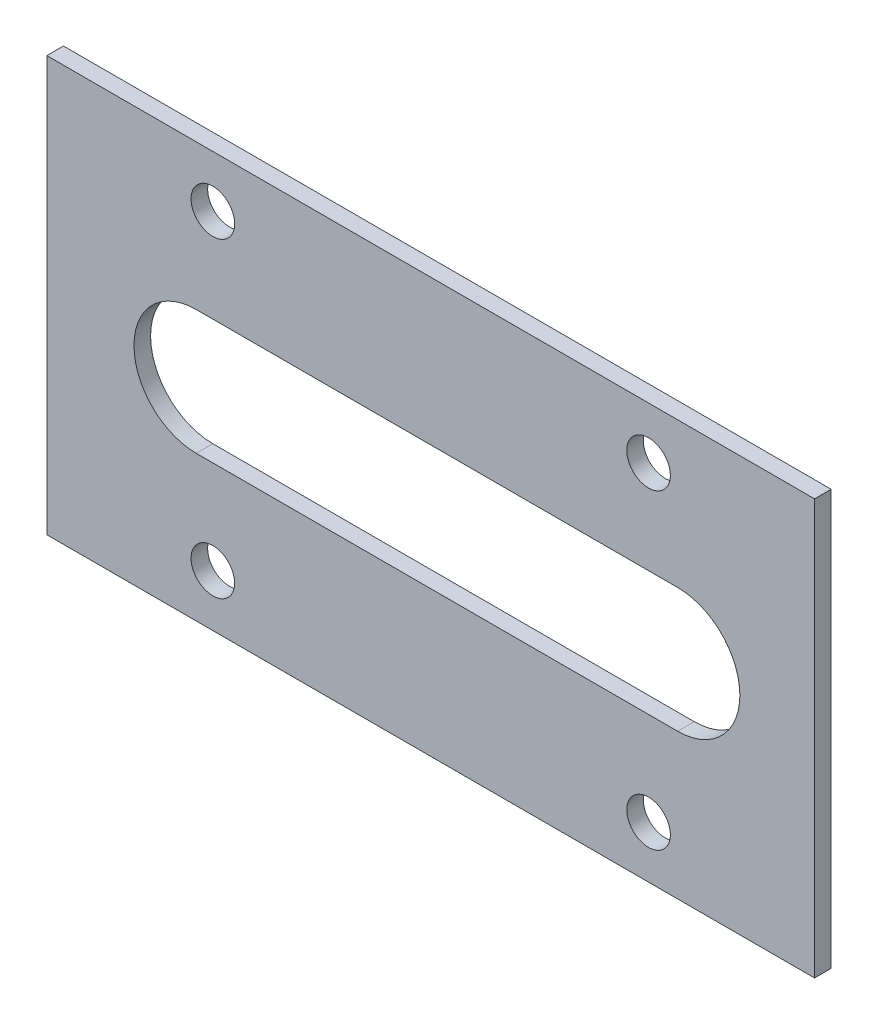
ISO-10303-21;
HEADER;
FILE_DESCRIPTION(('STEP AP214'),'2;1');
FILE_NAME('part.step','',(''),(''),'','','');
FILE_SCHEMA(('AUTOMOTIVE_DESIGN { 1 0 10303 214 1 1 1 1 }'));
ENDSEC;
DATA;
#1=APPLICATION_CONTEXT('core data for automotive mechanical design processes');
#2=APPLICATION_PROTOCOL_DEFINITION('international standard','automotive_design',2000,#1);
#3=PRODUCT_CONTEXT('',#1,'mechanical');
#4=PRODUCT('Part','Part','',(#3));
#5=PRODUCT_RELATED_PRODUCT_CATEGORY('part','',(#4));
#6=PRODUCT_DEFINITION_FORMATION('','',#4);
#7=PRODUCT_DEFINITION_CONTEXT('part definition',#1,'design');
#8=PRODUCT_DEFINITION('design','',#6,#7);
#9=PRODUCT_DEFINITION_SHAPE('','',#8);
#10=(LENGTH_UNIT() NAMED_UNIT(*) SI_UNIT(.MILLI.,.METRE.));
#11=(NAMED_UNIT(*) PLANE_ANGLE_UNIT() SI_UNIT($,.RADIAN.));
#12=(NAMED_UNIT(*) SI_UNIT($,.STERADIAN.) SOLID_ANGLE_UNIT());
#13=UNCERTAINTY_MEASURE_WITH_UNIT(LENGTH_MEASURE(1.E-05),#10,'distance_accuracy_value','');
#14=(GEOMETRIC_REPRESENTATION_CONTEXT(3) GLOBAL_UNCERTAINTY_ASSIGNED_CONTEXT((#13)) GLOBAL_UNIT_ASSIGNED_CONTEXT((#10,
#11,#12)) REPRESENTATION_CONTEXT('',''));
#15=CARTESIAN_POINT('',(0.,0.,0.));
#16=DIRECTION('',(0.,0.,1.));
#17=DIRECTION('',(1.,0.,0.));
#18=AXIS2_PLACEMENT_3D('',#15,#16,#17);
#19=CARTESIAN_POINT('',(-4.44089209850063E-13,2.22044604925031E-13,4.00000000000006));
#20=DIRECTION('',(0.,0.,1.));
#21=DIRECTION('',(1.,0.,0.));
#22=AXIS2_PLACEMENT_3D('',#19,#20,#21);
#23=PLANE('',#22);
#24=CARTESIAN_POINT('',(35.9999999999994,49.9999999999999,4.));
#25=DIRECTION('',(0.,0.,1.));
#26=DIRECTION('',(-1.,0.,0.));
#27=AXIS2_PLACEMENT_3D('',#24,#25,#26);
#28=CIRCLE('',#27,15.);
#29=CARTESIAN_POINT('',(35.9999999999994,65.0000000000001,3.99999999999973));
#30=VERTEX_POINT('',#29);
#31=CARTESIAN_POINT('',(35.9999999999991,35.,4.00000000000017));
#32=VERTEX_POINT('',#31);
#33=EDGE_CURVE('E68',#30,#32,#28,.T.);
#34=ORIENTED_EDGE('',*,*,#33,.F.);
#35=DIRECTION('',(-1.,0.,0.));
#36=VECTOR('',#35,1.);
#37=CARTESIAN_POINT('',(35.9999999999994,65.0000000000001,3.99999999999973));
#38=LINE('',#37,#36);
#39=CARTESIAN_POINT('',(151.999999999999,65.0000000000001,3.99999999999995));
#40=VERTEX_POINT('',#39);
#41=EDGE_CURVE('E137',#40,#30,#38,.T.);
#42=ORIENTED_EDGE('',*,*,#41,.F.);
#43=CARTESIAN_POINT('',(152.,50.0000000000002,3.99999999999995));
#44=DIRECTION('',(0.,0.,1.));
#45=DIRECTION('',(1.,0.,0.));
#46=AXIS2_PLACEMENT_3D('',#43,#44,#45);
#47=CIRCLE('',#46,15.);
#48=CARTESIAN_POINT('',(151.999999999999,35.0000000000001,4.00000000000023));
#49=VERTEX_POINT('',#48);
#50=EDGE_CURVE('E120',#49,#40,#47,.T.);
#51=ORIENTED_EDGE('',*,*,#50,.F.);
#52=DIRECTION('',(1.,0.,0.));
#53=VECTOR('',#52,1.);
#54=CARTESIAN_POINT('',(35.9999999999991,35.,4.00000000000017));
#55=LINE('',#54,#53);
#56=EDGE_CURVE('E130',#32,#49,#55,.T.);
#57=ORIENTED_EDGE('',*,*,#56,.F.);
#58=EDGE_LOOP('',(#34,#42,#51,#57));
#59=FACE_BOUND('',#58,.T.);
#60=CARTESIAN_POINT('',(145.,12.5,3.99999999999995));
#61=DIRECTION('',(0.,0.,1.));
#62=DIRECTION('',(1.,0.,0.));
#63=AXIS2_PLACEMENT_3D('',#60,#61,#62);
#64=CIRCLE('',#63,5.25);
#65=CARTESIAN_POINT('',(139.75,12.5,3.99999999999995));
#66=VERTEX_POINT('',#65);
#67=EDGE_CURVE('E177',#66,#66,#64,.T.);
#68=ORIENTED_EDGE('',*,*,#67,.F.);
#69=EDGE_LOOP('',(#68));
#70=FACE_BOUND('',#69,.T.);
#71=CARTESIAN_POINT('',(39.9999999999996,87.5,4.));
#72=DIRECTION('',(0.,0.,1.));
#73=DIRECTION('',(1.,0.,0.));
#74=AXIS2_PLACEMENT_3D('',#71,#72,#73);
#75=CIRCLE('',#74,5.25);
#76=CARTESIAN_POINT('',(34.7499999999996,87.5,4.));
#77=VERTEX_POINT('',#76);
#78=EDGE_CURVE('E193',#77,#77,#75,.T.);
#79=ORIENTED_EDGE('',*,*,#78,.F.);
#80=EDGE_LOOP('',(#79));
#81=FACE_BOUND('',#80,.T.);
#82=DIRECTION('',(0.,-1.,0.));
#83=VECTOR('',#82,1.);
#84=CARTESIAN_POINT('',(-6.66133814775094E-13,100.,4.));
#85=LINE('',#84,#83);
#86=CARTESIAN_POINT('',(-6.66133814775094E-13,100.,4.));
#87=VERTEX_POINT('',#86);
#88=CARTESIAN_POINT('',(-4.44089209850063E-13,2.22044604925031E-13,4.00000000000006));
#89=VERTEX_POINT('',#88);
#90=EDGE_CURVE('E209',#87,#89,#85,.T.);
#91=ORIENTED_EDGE('',*,*,#90,.T.);
#92=DIRECTION('',(1.,0.,0.));
#93=VECTOR('',#92,1.);
#94=CARTESIAN_POINT('',(-4.44089209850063E-13,2.22044604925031E-13,4.00000000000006));
#95=LINE('',#94,#93);
#96=CARTESIAN_POINT('',(185.,2.77555756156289E-13,3.99999999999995));
#97=VERTEX_POINT('',#96);
#98=EDGE_CURVE('E213',#89,#97,#95,.T.);
#99=ORIENTED_EDGE('',*,*,#98,.T.);
#100=DIRECTION('',(0.,1.,0.));
#101=VECTOR('',#100,1.);
#102=CARTESIAN_POINT('',(184.999999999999,100.,3.99999999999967));
#103=LINE('',#102,#101);
#104=CARTESIAN_POINT('',(184.999999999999,100.,3.99999999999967));
#105=VERTEX_POINT('',#104);
#106=EDGE_CURVE('E216',#97,#105,#103,.T.);
#107=ORIENTED_EDGE('',*,*,#106,.T.);
#108=DIRECTION('',(-1.,0.,0.));
#109=VECTOR('',#108,1.);
#110=CARTESIAN_POINT('',(-6.66133814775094E-13,100.,4.));
#111=LINE('',#110,#109);
#112=EDGE_CURVE('E219',#105,#87,#111,.T.);
#113=ORIENTED_EDGE('',*,*,#112,.T.);
#114=EDGE_LOOP('',(#91,#99,#107,#113));
#115=FACE_BOUND('',#114,.T.);
#116=CARTESIAN_POINT('',(145.,87.5000000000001,3.99999999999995));
#117=DIRECTION('',(0.,0.,1.));
#118=DIRECTION('',(1.,0.,0.));
#119=AXIS2_PLACEMENT_3D('',#116,#117,#118);
#120=CIRCLE('',#119,5.25);
#121=CARTESIAN_POINT('',(139.75,87.5000000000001,3.99999999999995));
#122=VERTEX_POINT('',#121);
#123=EDGE_CURVE('E185',#122,#122,#120,.T.);
#124=ORIENTED_EDGE('',*,*,#123,.F.);
#125=EDGE_LOOP('',(#124));
#126=FACE_BOUND('',#125,.T.);
#127=CARTESIAN_POINT('',(40.,12.5,4.00000000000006));
#128=DIRECTION('',(0.,0.,1.));
#129=DIRECTION('',(1.,0.,0.));
#130=AXIS2_PLACEMENT_3D('',#127,#128,#129);
#131=CIRCLE('',#130,5.25);
#132=CARTESIAN_POINT('',(34.75,12.5,4.00000000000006));
#133=VERTEX_POINT('',#132);
#134=EDGE_CURVE('E169',#133,#133,#131,.T.);
#135=ORIENTED_EDGE('',*,*,#134,.F.);
#136=EDGE_LOOP('',(#135));
#137=FACE_BOUND('',#136,.T.);
#138=ADVANCED_FACE('F52',(#59,#70,#81,#115,#126,#137),#23,.T.);
#139=CARTESIAN_POINT('',(0.,0.,0.));
#140=DIRECTION('',(0.,0.,1.));
#141=DIRECTION('',(1.,0.,0.));
#142=AXIS2_PLACEMENT_3D('',#139,#140,#141);
#143=PLANE('',#142);
#144=DIRECTION('',(-1.,0.,0.));
#145=VECTOR('',#144,1.);
#146=CARTESIAN_POINT('',(35.9999999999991,64.9999999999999,-1.11022302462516E-13));
#147=LINE('',#146,#145);
#148=CARTESIAN_POINT('',(152.,65.0000000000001,0.));
#149=VERTEX_POINT('',#148);
#150=CARTESIAN_POINT('',(35.9999999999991,64.9999999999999,-1.11022302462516E-13));
#151=VERTEX_POINT('',#150);
#152=EDGE_CURVE('E154',#149,#151,#147,.T.);
#153=ORIENTED_EDGE('',*,*,#152,.T.);
#154=CARTESIAN_POINT('',(35.9999999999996,49.9999999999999,1.11022302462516E-13));
#155=DIRECTION('',(0.,0.,1.));
#156=DIRECTION('',(-1.,0.,0.));
#157=AXIS2_PLACEMENT_3D('',#154,#155,#156);
#158=CIRCLE('',#157,15.);
#159=CARTESIAN_POINT('',(35.9999999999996,35.,1.66533453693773E-13));
#160=VERTEX_POINT('',#159);
#161=EDGE_CURVE('E143',#151,#160,#158,.T.);
#162=ORIENTED_EDGE('',*,*,#161,.T.);
#163=DIRECTION('',(1.,0.,0.));
#164=VECTOR('',#163,1.);
#165=CARTESIAN_POINT('',(35.9999999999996,35.,1.66533453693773E-13));
#166=LINE('',#165,#164);
#167=CARTESIAN_POINT('',(152.,35.,0.));
#168=VERTEX_POINT('',#167);
#169=EDGE_CURVE('E149',#160,#168,#166,.T.);
#170=ORIENTED_EDGE('',*,*,#169,.T.);
#171=CARTESIAN_POINT('',(151.999999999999,50.,2.22044604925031E-13));
#172=DIRECTION('',(0.,0.,1.));
#173=DIRECTION('',(1.,0.,0.));
#174=AXIS2_PLACEMENT_3D('',#171,#172,#173);
#175=CIRCLE('',#174,15.);
#176=EDGE_CURVE('E76',#168,#149,#175,.T.);
#177=ORIENTED_EDGE('',*,*,#176,.T.);
#178=EDGE_LOOP('',(#153,#162,#170,#177));
#179=FACE_BOUND('',#178,.T.);
#180=CARTESIAN_POINT('',(144.999999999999,12.5000000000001,-1.66533453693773E-13));
#181=DIRECTION('',(0.,0.,1.));
#182=DIRECTION('',(1.,0.,0.));
#183=AXIS2_PLACEMENT_3D('',#180,#181,#182);
#184=CIRCLE('',#183,5.25);
#185=CARTESIAN_POINT('',(139.75,12.5,-1.66533453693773E-13));
#186=VERTEX_POINT('',#185);
#187=EDGE_CURVE('E173',#186,#186,#184,.T.);
#188=ORIENTED_EDGE('',*,*,#187,.T.);
#189=EDGE_LOOP('',(#188));
#190=FACE_BOUND('',#189,.T.);
#191=CARTESIAN_POINT('',(39.9999999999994,87.5000000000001,1.11022302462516E-13));
#192=DIRECTION('',(0.,0.,1.));
#193=DIRECTION('',(1.,0.,0.));
#194=AXIS2_PLACEMENT_3D('',#191,#192,#193);
#195=CIRCLE('',#194,5.25);
#196=CARTESIAN_POINT('',(34.7499999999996,87.5,1.11022302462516E-13));
#197=VERTEX_POINT('',#196);
#198=EDGE_CURVE('E189',#197,#197,#195,.T.);
#199=ORIENTED_EDGE('',*,*,#198,.T.);
#200=EDGE_LOOP('',(#199));
#201=FACE_BOUND('',#200,.T.);
#202=DIRECTION('',(0.,-1.,0.));
#203=VECTOR('',#202,1.);
#204=CARTESIAN_POINT('',(-2.22044604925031E-13,100.,2.22044604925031E-13));
#205=LINE('',#204,#203);
#206=CARTESIAN_POINT('',(-2.22044604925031E-13,100.,2.22044604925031E-13));
#207=VERTEX_POINT('',#206);
#208=CARTESIAN_POINT('',(0.,0.,0.));
#209=VERTEX_POINT('',#208);
#210=EDGE_CURVE('E197',#207,#209,#205,.T.);
#211=ORIENTED_EDGE('',*,*,#210,.F.);
#212=DIRECTION('',(-1.,0.,0.));
#213=VECTOR('',#212,1.);
#214=CARTESIAN_POINT('',(-2.22044604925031E-13,100.,2.22044604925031E-13));
#215=LINE('',#214,#213);
#216=CARTESIAN_POINT('',(185.,100.,-1.11022302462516E-13));
#217=VERTEX_POINT('',#216);
#218=EDGE_CURVE('E207',#217,#207,#215,.T.);
#219=ORIENTED_EDGE('',*,*,#218,.F.);
#220=DIRECTION('',(0.,1.,0.));
#221=VECTOR('',#220,1.);
#222=CARTESIAN_POINT('',(185.,100.,-1.11022302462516E-13));
#223=LINE('',#222,#221);
#224=CARTESIAN_POINT('',(185.,-1.11022302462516E-13,0.));
#225=VERTEX_POINT('',#224);
#226=EDGE_CURVE('E204',#225,#217,#223,.T.);
#227=ORIENTED_EDGE('',*,*,#226,.F.);
#228=DIRECTION('',(1.,0.,0.));
#229=VECTOR('',#228,1.);
#230=CARTESIAN_POINT('',(0.,0.,0.));
#231=LINE('',#230,#229);
#232=EDGE_CURVE('E201',#209,#225,#231,.T.);
#233=ORIENTED_EDGE('',*,*,#232,.F.);
#234=EDGE_LOOP('',(#211,#219,#227,#233));
#235=FACE_BOUND('',#234,.T.);
#236=CARTESIAN_POINT('',(144.999999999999,87.5000000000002,2.22044604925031E-13));
#237=DIRECTION('',(0.,0.,1.));
#238=DIRECTION('',(1.,0.,0.));
#239=AXIS2_PLACEMENT_3D('',#236,#237,#238);
#240=CIRCLE('',#239,5.25);
#241=CARTESIAN_POINT('',(139.75,87.5000000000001,2.22044604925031E-13));
#242=VERTEX_POINT('',#241);
#243=EDGE_CURVE('E181',#242,#242,#240,.T.);
#244=ORIENTED_EDGE('',*,*,#243,.T.);
#245=EDGE_LOOP('',(#244));
#246=FACE_BOUND('',#245,.T.);
#247=CARTESIAN_POINT('',(40.,12.5,0.));
#248=DIRECTION('',(0.,0.,1.));
#249=DIRECTION('',(1.,0.,0.));
#250=AXIS2_PLACEMENT_3D('',#247,#248,#249);
#251=CIRCLE('',#250,5.25);
#252=CARTESIAN_POINT('',(34.75,12.5,0.));
#253=VERTEX_POINT('',#252);
#254=EDGE_CURVE('E161',#253,#253,#251,.T.);
#255=ORIENTED_EDGE('',*,*,#254,.T.);
#256=EDGE_LOOP('',(#255));
#257=FACE_BOUND('',#256,.T.);
#258=ADVANCED_FACE('F241',(#179,#190,#201,#235,#246,#257),#143,.F.);
#259=CARTESIAN_POINT('',(-6.66133814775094E-13,100.,4.));
#260=DIRECTION('',(1.,0.,0.));
#261=DIRECTION('',(0.,1.,0.));
#262=AXIS2_PLACEMENT_3D('',#259,#260,#261);
#263=PLANE('',#262);
#264=ORIENTED_EDGE('',*,*,#210,.T.);
#265=DIRECTION('',(0.,0.,-1.));
#266=VECTOR('',#265,1.);
#267=CARTESIAN_POINT('',(-4.44089209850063E-13,2.22044604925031E-13,4.00000000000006));
#268=LINE('',#267,#266);
#269=EDGE_CURVE('E11',#89,#209,#268,.T.);
#270=ORIENTED_EDGE('',*,*,#269,.F.);
#271=ORIENTED_EDGE('',*,*,#90,.F.);
#272=DIRECTION('',(0.,0.,-1.));
#273=VECTOR('',#272,1.);
#274=CARTESIAN_POINT('',(-6.66133814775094E-13,100.,4.));
#275=LINE('',#274,#273);
#276=EDGE_CURVE('E222',#87,#207,#275,.T.);
#277=ORIENTED_EDGE('',*,*,#276,.T.);
#278=EDGE_LOOP('',(#264,#270,#271,#277));
#279=FACE_BOUND('',#278,.T.);
#280=ADVANCED_FACE('F54',(#279),#263,.F.);
#281=CARTESIAN_POINT('',(-4.44089209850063E-13,2.22044604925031E-13,4.00000000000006));
#282=DIRECTION('',(0.,1.,0.));
#283=DIRECTION('',(0.,0.,1.));
#284=AXIS2_PLACEMENT_3D('',#281,#282,#283);
#285=PLANE('',#284);
#286=ORIENTED_EDGE('',*,*,#232,.T.);
#287=DIRECTION('',(0.,0.,-1.));
#288=VECTOR('',#287,1.);
#289=CARTESIAN_POINT('',(185.,2.77555756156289E-13,3.99999999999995));
#290=LINE('',#289,#288);
#291=EDGE_CURVE('E61',#97,#225,#290,.T.);
#292=ORIENTED_EDGE('',*,*,#291,.F.);
#293=ORIENTED_EDGE('',*,*,#98,.F.);
#294=ORIENTED_EDGE('',*,*,#269,.T.);
#295=EDGE_LOOP('',(#286,#292,#293,#294));
#296=FACE_BOUND('',#295,.T.);
#297=ADVANCED_FACE('F252',(#296),#285,.F.);
#298=CARTESIAN_POINT('',(184.999999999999,100.,3.99999999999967));
#299=DIRECTION('',(-1.,0.,0.));
#300=DIRECTION('',(0.,0.,1.));
#301=AXIS2_PLACEMENT_3D('',#298,#299,#300);
#302=PLANE('',#301);
#303=ORIENTED_EDGE('',*,*,#226,.T.);
#304=DIRECTION('',(0.,0.,-1.));
#305=VECTOR('',#304,1.);
#306=CARTESIAN_POINT('',(184.999999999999,100.,3.99999999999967));
#307=LINE('',#306,#305);
#308=EDGE_CURVE('E226',#105,#217,#307,.T.);
#309=ORIENTED_EDGE('',*,*,#308,.F.);
#310=ORIENTED_EDGE('',*,*,#106,.F.);
#311=ORIENTED_EDGE('',*,*,#291,.T.);
#312=EDGE_LOOP('',(#303,#309,#310,#311));
#313=FACE_BOUND('',#312,.T.);
#314=ADVANCED_FACE('F235',(#313),#302,.F.);
#315=CARTESIAN_POINT('',(-6.66133814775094E-13,100.,4.));
#316=DIRECTION('',(0.,-1.,0.));
#317=DIRECTION('',(0.,0.,-1.));
#318=AXIS2_PLACEMENT_3D('',#315,#316,#317);
#319=PLANE('',#318);
#320=ORIENTED_EDGE('',*,*,#218,.T.);
#321=ORIENTED_EDGE('',*,*,#276,.F.);
#322=ORIENTED_EDGE('',*,*,#112,.F.);
#323=ORIENTED_EDGE('',*,*,#308,.T.);
#324=EDGE_LOOP('',(#320,#321,#322,#323));
#325=FACE_BOUND('',#324,.T.);
#326=ADVANCED_FACE('F245',(#325),#319,.F.);
#327=CARTESIAN_POINT('',(39.9999999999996,87.5,4.));
#328=DIRECTION('',(0.,0.,-1.));
#329=DIRECTION('',(-1.,0.,0.));
#330=AXIS2_PLACEMENT_3D('',#327,#328,#329);
#331=CYLINDRICAL_SURFACE('',#330,5.25);
#332=CARTESIAN_POINT('',(34.7499999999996,87.5,4.));
#333=CARTESIAN_POINT('',(34.7499999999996,87.5,3.95833333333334));
#334=CARTESIAN_POINT('',(34.7499999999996,87.5,3.91666666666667));
#335=CARTESIAN_POINT('',(34.7499999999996,87.5,3.83333333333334));
#336=CARTESIAN_POINT('',(34.7499999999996,87.5,3.79166666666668));
#337=CARTESIAN_POINT('',(34.7499999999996,87.5,3.70833333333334));
#338=CARTESIAN_POINT('',(34.7499999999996,87.5,3.66666666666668));
#339=CARTESIAN_POINT('',(34.7499999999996,87.5,3.58333333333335));
#340=CARTESIAN_POINT('',(34.7499999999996,87.5,3.54166666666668));
#341=CARTESIAN_POINT('',(34.7499999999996,87.5,3.45833333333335));
#342=CARTESIAN_POINT('',(34.7499999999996,87.5,3.41666666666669));
#343=CARTESIAN_POINT('',(34.7499999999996,87.5,3.33333333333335));
#344=CARTESIAN_POINT('',(34.7499999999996,87.5,3.29166666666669));
#345=CARTESIAN_POINT('',(34.7499999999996,87.5,3.20833333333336));
#346=CARTESIAN_POINT('',(34.7499999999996,87.5,3.16666666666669));
#347=CARTESIAN_POINT('',(34.7499999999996,87.5,3.08333333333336));
#348=CARTESIAN_POINT('',(34.7499999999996,87.5,3.0416666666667));
#349=CARTESIAN_POINT('',(34.7499999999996,87.5,2.95833333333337));
#350=CARTESIAN_POINT('',(34.7499999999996,87.5,2.9166666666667));
#351=CARTESIAN_POINT('',(34.7499999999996,87.5,2.83333333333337));
#352=CARTESIAN_POINT('',(34.7499999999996,87.5,2.7916666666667));
#353=CARTESIAN_POINT('',(34.7499999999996,87.5,2.70833333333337));
#354=CARTESIAN_POINT('',(34.7499999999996,87.5,2.66666666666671));
#355=CARTESIAN_POINT('',(34.7499999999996,87.5,2.58333333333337));
#356=CARTESIAN_POINT('',(34.7499999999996,87.5,2.54166666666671));
#357=CARTESIAN_POINT('',(34.7499999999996,87.5,2.45833333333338));
#358=CARTESIAN_POINT('',(34.7499999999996,87.5,2.41666666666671));
#359=CARTESIAN_POINT('',(34.7499999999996,87.5,2.33333333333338));
#360=CARTESIAN_POINT('',(34.7499999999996,87.5,2.29166666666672));
#361=CARTESIAN_POINT('',(34.7499999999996,87.5,2.20833333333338));
#362=CARTESIAN_POINT('',(34.7499999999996,87.5,2.16666666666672));
#363=CARTESIAN_POINT('',(34.7499999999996,87.5,2.08333333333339));
#364=CARTESIAN_POINT('',(34.7499999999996,87.5,2.04166666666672));
#365=CARTESIAN_POINT('',(34.7499999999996,87.5,1.95833333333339));
#366=CARTESIAN_POINT('',(34.7499999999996,87.5,1.91666666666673));
#367=CARTESIAN_POINT('',(34.7499999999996,87.5,1.8333333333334));
#368=CARTESIAN_POINT('',(34.7499999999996,87.5,1.79166666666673));
#369=CARTESIAN_POINT('',(34.7499999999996,87.5,1.7083333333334));
#370=CARTESIAN_POINT('',(34.7499999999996,87.5,1.66666666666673));
#371=CARTESIAN_POINT('',(34.7499999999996,87.5,1.5833333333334));
#372=CARTESIAN_POINT('',(34.7499999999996,87.5,1.54166666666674));
#373=CARTESIAN_POINT('',(34.7499999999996,87.5,1.45833333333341));
#374=CARTESIAN_POINT('',(34.7499999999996,87.5,1.41666666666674));
#375=CARTESIAN_POINT('',(34.7499999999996,87.5,1.33333333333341));
#376=CARTESIAN_POINT('',(34.7499999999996,87.5,1.29166666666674));
#377=CARTESIAN_POINT('',(34.7499999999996,87.5,1.20833333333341));
#378=CARTESIAN_POINT('',(34.7499999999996,87.5,1.16666666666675));
#379=CARTESIAN_POINT('',(34.7499999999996,87.5,1.08333333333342));
#380=CARTESIAN_POINT('',(34.7499999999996,87.5,1.04166666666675));
#381=CARTESIAN_POINT('',(34.7499999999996,87.5,0.958333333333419));
#382=CARTESIAN_POINT('',(34.7499999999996,87.5,0.916666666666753));
#383=CARTESIAN_POINT('',(34.7499999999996,87.5,0.833333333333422));
#384=CARTESIAN_POINT('',(34.7499999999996,87.5,0.791666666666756));
#385=CARTESIAN_POINT('',(34.7499999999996,87.5,0.708333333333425));
#386=CARTESIAN_POINT('',(34.7499999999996,87.5,0.66666666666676));
#387=CARTESIAN_POINT('',(34.7499999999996,87.5,0.583333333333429));
#388=CARTESIAN_POINT('',(34.7499999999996,87.5,0.541666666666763));
#389=CARTESIAN_POINT('',(34.7499999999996,87.5,0.458333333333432));
#390=CARTESIAN_POINT('',(34.7499999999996,87.5,0.416666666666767));
#391=CARTESIAN_POINT('',(34.7499999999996,87.5,0.333333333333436));
#392=CARTESIAN_POINT('',(34.7499999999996,87.5,0.29166666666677));
#393=CARTESIAN_POINT('',(34.7499999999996,87.5,0.208333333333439));
#394=CARTESIAN_POINT('',(34.7499999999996,87.5,0.166666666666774));
#395=CARTESIAN_POINT('',(34.7499999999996,87.5,0.0833333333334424));
#396=CARTESIAN_POINT('',(34.7499999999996,87.5,0.0416666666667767));
#397=CARTESIAN_POINT('',(34.7499999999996,87.5,1.11022302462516E-13));
#398=B_SPLINE_CURVE_WITH_KNOTS('',3,(#332,#333,#334,#335,#336,#337,#338,#339,#340,#341,#342,
#343,#344,#345,#346,#347,#348,#349,#350,#351,#352,#353,#354,#355,#356,#357,#358,#359,#360,#361,
#362,#363,#364,#365,#366,#367,#368,#369,#370,#371,#372,#373,#374,#375,#376,#377,#378,#379,#380,
#381,#382,#383,#384,#385,#386,#387,#388,#389,#390,#391,#392,#393,#394,#395,#396,#397),
.UNSPECIFIED.,.F.,.F.,(4,2,2,2,2,2,2,2,2,2,2,2,2,2,2,2,2,2,2,2,2,2,2,2,2,2,2,2,2,2,2,2,4),(0.,
0.124999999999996,0.249999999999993,0.37499999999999,0.499999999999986,0.624999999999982,
0.749999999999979,0.874999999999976,0.999999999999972,1.12499999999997,1.24999999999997,
1.37499999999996,1.49999999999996,1.62499999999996,1.74999999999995,1.87499999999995,
1.99999999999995,2.12499999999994,2.24999999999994,2.37499999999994,2.49999999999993,
2.62499999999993,2.74999999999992,2.87499999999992,2.99999999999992,3.12499999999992,
3.24999999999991,3.37499999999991,3.4999999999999,3.6249999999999,3.7499999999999,
3.87499999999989,3.99999999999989),.UNSPECIFIED.);
#399=EDGE_CURVE('BSEAM269',#77,#197,#398,.T.);
#400=ORIENTED_EDGE('',*,*,#78,.T.);
#401=ORIENTED_EDGE('',*,*,#198,.F.);
#402=ORIENTED_EDGE('',*,*,#399,.T.);
#403=ORIENTED_EDGE('',*,*,#399,.F.);
#404=EDGE_LOOP('',(#400,#402,#401,#403));
#405=FACE_BOUND('',#404,.T.);
#406=ADVANCED_FACE('F269',(#405),#331,.F.);
#407=CARTESIAN_POINT('',(145.,87.5000000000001,3.99999999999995));
#408=DIRECTION('',(0.,0.,-1.));
#409=DIRECTION('',(-1.,0.,0.));
#410=AXIS2_PLACEMENT_3D('',#407,#408,#409);
#411=CYLINDRICAL_SURFACE('',#410,5.25);
#412=CARTESIAN_POINT('',(139.75,87.5000000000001,3.99999999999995));
#413=CARTESIAN_POINT('',(139.75,87.5000000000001,3.95833333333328));
#414=CARTESIAN_POINT('',(139.75,87.5000000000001,3.91666666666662));
#415=CARTESIAN_POINT('',(139.75,87.5000000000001,3.83333333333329));
#416=CARTESIAN_POINT('',(139.75,87.5000000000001,3.79166666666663));
#417=CARTESIAN_POINT('',(139.75,87.5000000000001,3.7083333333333));
#418=CARTESIAN_POINT('',(139.75,87.5000000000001,3.66666666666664));
#419=CARTESIAN_POINT('',(139.75,87.5000000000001,3.58333333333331));
#420=CARTESIAN_POINT('',(139.75,87.5000000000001,3.54166666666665));
#421=CARTESIAN_POINT('',(139.75,87.5000000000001,3.45833333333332));
#422=CARTESIAN_POINT('',(139.75,87.5000000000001,3.41666666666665));
#423=CARTESIAN_POINT('',(139.75,87.5000000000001,3.33333333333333));
#424=CARTESIAN_POINT('',(139.75,87.5000000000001,3.29166666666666));
#425=CARTESIAN_POINT('',(139.75,87.5000000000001,3.20833333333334));
#426=CARTESIAN_POINT('',(139.75,87.5000000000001,3.16666666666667));
#427=CARTESIAN_POINT('',(139.75,87.5000000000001,3.08333333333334));
#428=CARTESIAN_POINT('',(139.75,87.5000000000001,3.04166666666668));
#429=CARTESIAN_POINT('',(139.75,87.5000000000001,2.95833333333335));
#430=CARTESIAN_POINT('',(139.75,87.5000000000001,2.91666666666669));
#431=CARTESIAN_POINT('',(139.75,87.5000000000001,2.83333333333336));
#432=CARTESIAN_POINT('',(139.75,87.5000000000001,2.7916666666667));
#433=CARTESIAN_POINT('',(139.75,87.5000000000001,2.70833333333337));
#434=CARTESIAN_POINT('',(139.75,87.5000000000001,2.66666666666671));
#435=CARTESIAN_POINT('',(139.75,87.5000000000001,2.58333333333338));
#436=CARTESIAN_POINT('',(139.75,87.5000000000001,2.54166666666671));
#437=CARTESIAN_POINT('',(139.75,87.5000000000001,2.45833333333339));
#438=CARTESIAN_POINT('',(139.75,87.5000000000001,2.41666666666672));
#439=CARTESIAN_POINT('',(139.75,87.5000000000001,2.3333333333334));
#440=CARTESIAN_POINT('',(139.75,87.5000000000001,2.29166666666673));
#441=CARTESIAN_POINT('',(139.75,87.5000000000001,2.2083333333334));
#442=CARTESIAN_POINT('',(139.75,87.5000000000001,2.16666666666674));
#443=CARTESIAN_POINT('',(139.75,87.5000000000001,2.08333333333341));
#444=CARTESIAN_POINT('',(139.75,87.5000000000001,2.04166666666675));
#445=CARTESIAN_POINT('',(139.75,87.5000000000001,1.95833333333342));
#446=CARTESIAN_POINT('',(139.75,87.5000000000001,1.91666666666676));
#447=CARTESIAN_POINT('',(139.75,87.5000000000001,1.83333333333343));
#448=CARTESIAN_POINT('',(139.75,87.5000000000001,1.79166666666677));
#449=CARTESIAN_POINT('',(139.75,87.5000000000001,1.70833333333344));
#450=CARTESIAN_POINT('',(139.75,87.5000000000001,1.66666666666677));
#451=CARTESIAN_POINT('',(139.75,87.5000000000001,1.58333333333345));
#452=CARTESIAN_POINT('',(139.75,87.5000000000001,1.54166666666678));
#453=CARTESIAN_POINT('',(139.75,87.5000000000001,1.45833333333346));
#454=CARTESIAN_POINT('',(139.75,87.5000000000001,1.41666666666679));
#455=CARTESIAN_POINT('',(139.75,87.5000000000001,1.33333333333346));
#456=CARTESIAN_POINT('',(139.75,87.5000000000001,1.2916666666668));
#457=CARTESIAN_POINT('',(139.75,87.5000000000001,1.20833333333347));
#458=CARTESIAN_POINT('',(139.75,87.5000000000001,1.16666666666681));
#459=CARTESIAN_POINT('',(139.75,87.5000000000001,1.08333333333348));
#460=CARTESIAN_POINT('',(139.75,87.5000000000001,1.04166666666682));
#461=CARTESIAN_POINT('',(139.75,87.5000000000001,0.95833333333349));
#462=CARTESIAN_POINT('',(139.75,87.5000000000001,0.916666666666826));
#463=CARTESIAN_POINT('',(139.75,87.5000000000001,0.833333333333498));
#464=CARTESIAN_POINT('',(139.75,87.5000000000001,0.791666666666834));
#465=CARTESIAN_POINT('',(139.75,87.5000000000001,0.708333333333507));
#466=CARTESIAN_POINT('',(139.75,87.5000000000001,0.666666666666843));
#467=CARTESIAN_POINT('',(139.75,87.5000000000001,0.583333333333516));
#468=CARTESIAN_POINT('',(139.75,87.5000000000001,0.541666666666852));
#469=CARTESIAN_POINT('',(139.75,87.5000000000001,0.458333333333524));
#470=CARTESIAN_POINT('',(139.75,87.5000000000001,0.416666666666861));
#471=CARTESIAN_POINT('',(139.75,87.5000000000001,0.333333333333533));
#472=CARTESIAN_POINT('',(139.75,87.5000000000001,0.291666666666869));
#473=CARTESIAN_POINT('',(139.75,87.5000000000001,0.208333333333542));
#474=CARTESIAN_POINT('',(139.75,87.5000000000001,0.166666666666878));
#475=CARTESIAN_POINT('',(139.75,87.5000000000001,0.08333333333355));
#476=CARTESIAN_POINT('',(139.75,87.5000000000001,0.041666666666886));
#477=CARTESIAN_POINT('',(139.75,87.5000000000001,2.22044604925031E-13));
#478=B_SPLINE_CURVE_WITH_KNOTS('',3,(#412,#413,#414,#415,#416,#417,#418,#419,#420,#421,#422,
#423,#424,#425,#426,#427,#428,#429,#430,#431,#432,#433,#434,#435,#436,#437,#438,#439,#440,#441,
#442,#443,#444,#445,#446,#447,#448,#449,#450,#451,#452,#453,#454,#455,#456,#457,#458,#459,#460,
#461,#462,#463,#464,#465,#466,#467,#468,#469,#470,#471,#472,#473,#474,#475,#476,#477),
.UNSPECIFIED.,.F.,.F.,(4,2,2,2,2,2,2,2,2,2,2,2,2,2,2,2,2,2,2,2,2,2,2,2,2,2,2,2,2,2,2,2,4),(0.,
0.124999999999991,0.249999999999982,0.374999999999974,0.499999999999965,0.624999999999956,
0.749999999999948,0.874999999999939,0.999999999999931,1.12499999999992,1.24999999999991,
1.3749999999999,1.4999999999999,1.62499999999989,1.74999999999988,1.87499999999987,
1.99999999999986,2.12499999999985,2.24999999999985,2.37499999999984,2.49999999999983,
2.62499999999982,2.74999999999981,2.8749999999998,2.99999999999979,3.12499999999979,
3.24999999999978,3.37499999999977,3.49999999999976,3.62499999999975,3.74999999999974,
3.87499999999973,3.99999999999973),.UNSPECIFIED.);
#479=EDGE_CURVE('BSEAM273',#122,#242,#478,.T.);
#480=ORIENTED_EDGE('',*,*,#123,.T.);
#481=ORIENTED_EDGE('',*,*,#243,.F.);
#482=ORIENTED_EDGE('',*,*,#479,.T.);
#483=ORIENTED_EDGE('',*,*,#479,.F.);
#484=EDGE_LOOP('',(#480,#482,#481,#483));
#485=FACE_BOUND('',#484,.T.);
#486=ADVANCED_FACE('F273',(#485),#411,.F.);
#487=CARTESIAN_POINT('',(145.,12.5,3.99999999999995));
#488=DIRECTION('',(0.,0.,-1.));
#489=DIRECTION('',(-1.,0.,0.));
#490=AXIS2_PLACEMENT_3D('',#487,#488,#489);
#491=CYLINDRICAL_SURFACE('',#490,5.25);
#492=CARTESIAN_POINT('',(139.75,12.5,3.99999999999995));
#493=CARTESIAN_POINT('',(139.75,12.5,3.95833333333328));
#494=CARTESIAN_POINT('',(139.75,12.5,3.91666666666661));
#495=CARTESIAN_POINT('',(139.75,12.5,3.83333333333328));
#496=CARTESIAN_POINT('',(139.75,12.5,3.79166666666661));
#497=CARTESIAN_POINT('',(139.75,12.5,3.70833333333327));
#498=CARTESIAN_POINT('',(139.75,12.5,3.6666666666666));
#499=CARTESIAN_POINT('',(139.75,12.5,3.58333333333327));
#500=CARTESIAN_POINT('',(139.75,12.5,3.5416666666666));
#501=CARTESIAN_POINT('',(139.75,12.5,3.45833333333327));
#502=CARTESIAN_POINT('',(139.75,12.5,3.4166666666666));
#503=CARTESIAN_POINT('',(139.75,12.5,3.33333333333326));
#504=CARTESIAN_POINT('',(139.75,12.5,3.29166666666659));
#505=CARTESIAN_POINT('',(139.75,12.5,3.20833333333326));
#506=CARTESIAN_POINT('',(139.75,12.5,3.16666666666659));
#507=CARTESIAN_POINT('',(139.75,12.5,3.08333333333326));
#508=CARTESIAN_POINT('',(139.75,12.5,3.04166666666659));
#509=CARTESIAN_POINT('',(139.75,12.5,2.95833333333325));
#510=CARTESIAN_POINT('',(139.75,12.5,2.91666666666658));
#511=CARTESIAN_POINT('',(139.75,12.5,2.83333333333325));
#512=CARTESIAN_POINT('',(139.75,12.5,2.79166666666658));
#513=CARTESIAN_POINT('',(139.75,12.5,2.70833333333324));
#514=CARTESIAN_POINT('',(139.75,12.5,2.66666666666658));
#515=CARTESIAN_POINT('',(139.75,12.5,2.58333333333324));
#516=CARTESIAN_POINT('',(139.75,12.5,2.54166666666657));
#517=CARTESIAN_POINT('',(139.75,12.5,2.45833333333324));
#518=CARTESIAN_POINT('',(139.75,12.5,2.41666666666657));
#519=CARTESIAN_POINT('',(139.75,12.5,2.33333333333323));
#520=CARTESIAN_POINT('',(139.75,12.5,2.29166666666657));
#521=CARTESIAN_POINT('',(139.75,12.5,2.20833333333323));
#522=CARTESIAN_POINT('',(139.75,12.5,2.16666666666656));
#523=CARTESIAN_POINT('',(139.75,12.5,2.08333333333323));
#524=CARTESIAN_POINT('',(139.75,12.5,2.04166666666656));
#525=CARTESIAN_POINT('',(139.75,12.5,1.95833333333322));
#526=CARTESIAN_POINT('',(139.75,12.5,1.91666666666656));
#527=CARTESIAN_POINT('',(139.75,12.5,1.83333333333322));
#528=CARTESIAN_POINT('',(139.75,12.5,1.79166666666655));
#529=CARTESIAN_POINT('',(139.75,12.5,1.70833333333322));
#530=CARTESIAN_POINT('',(139.75,12.5,1.66666666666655));
#531=CARTESIAN_POINT('',(139.75,12.5,1.58333333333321));
#532=CARTESIAN_POINT('',(139.75,12.5,1.54166666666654));
#533=CARTESIAN_POINT('',(139.75,12.5,1.45833333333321));
#534=CARTESIAN_POINT('',(139.75,12.5,1.41666666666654));
#535=CARTESIAN_POINT('',(139.75,12.5,1.33333333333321));
#536=CARTESIAN_POINT('',(139.75,12.5,1.29166666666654));
#537=CARTESIAN_POINT('',(139.75,12.5,1.2083333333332));
#538=CARTESIAN_POINT('',(139.75,12.5,1.16666666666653));
#539=CARTESIAN_POINT('',(139.75,12.5,1.0833333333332));
#540=CARTESIAN_POINT('',(139.75,12.5,1.04166666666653));
#541=CARTESIAN_POINT('',(139.75,12.5,0.958333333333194));
#542=CARTESIAN_POINT('',(139.75,12.5,0.916666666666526));
#543=CARTESIAN_POINT('',(139.75,12.5,0.833333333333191));
#544=CARTESIAN_POINT('',(139.75,12.5,0.791666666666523));
#545=CARTESIAN_POINT('',(139.75,12.5,0.708333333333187));
#546=CARTESIAN_POINT('',(139.75,12.5,0.666666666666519));
#547=CARTESIAN_POINT('',(139.75,12.5,0.583333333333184));
#548=CARTESIAN_POINT('',(139.75,12.5,0.541666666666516));
#549=CARTESIAN_POINT('',(139.75,12.5,0.45833333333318));
#550=CARTESIAN_POINT('',(139.75,12.5,0.416666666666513));
#551=CARTESIAN_POINT('',(139.75,12.5,0.333333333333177));
#552=CARTESIAN_POINT('',(139.75,12.5,0.291666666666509));
#553=CARTESIAN_POINT('',(139.75,12.5,0.208333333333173));
#554=CARTESIAN_POINT('',(139.75,12.5,0.166666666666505));
#555=CARTESIAN_POINT('',(139.75,12.5,0.0833333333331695));
#556=CARTESIAN_POINT('',(139.75,12.5,0.0416666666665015));
#557=CARTESIAN_POINT('',(139.75,12.5,-1.66533453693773E-13));
#558=B_SPLINE_CURVE_WITH_KNOTS('',3,(#492,#493,#494,#495,#496,#497,#498,#499,#500,#501,#502,
#503,#504,#505,#506,#507,#508,#509,#510,#511,#512,#513,#514,#515,#516,#517,#518,#519,#520,#521,
#522,#523,#524,#525,#526,#527,#528,#529,#530,#531,#532,#533,#534,#535,#536,#537,#538,#539,#540,
#541,#542,#543,#544,#545,#546,#547,#548,#549,#550,#551,#552,#553,#554,#555,#556,#557),
.UNSPECIFIED.,.F.,.F.,(4,2,2,2,2,2,2,2,2,2,2,2,2,2,2,2,2,2,2,2,2,2,2,2,2,2,2,2,2,2,2,2,4),(0.,
0.125000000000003,0.250000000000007,0.37500000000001,0.500000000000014,0.625000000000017,
0.750000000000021,0.875000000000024,1.00000000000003,1.12500000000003,1.25000000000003,
1.37500000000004,1.50000000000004,1.62500000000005,1.75000000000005,1.87500000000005,
2.00000000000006,2.12500000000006,2.25000000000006,2.37500000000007,2.50000000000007,
2.62500000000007,2.75000000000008,2.87500000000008,3.00000000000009,3.12500000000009,
3.25000000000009,3.3750000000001,3.5000000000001,3.6250000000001,3.75000000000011,
3.87500000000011,4.00000000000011),.UNSPECIFIED.);
#559=EDGE_CURVE('BSEAM278',#66,#186,#558,.T.);
#560=ORIENTED_EDGE('',*,*,#67,.T.);
#561=ORIENTED_EDGE('',*,*,#187,.F.);
#562=ORIENTED_EDGE('',*,*,#559,.T.);
#563=ORIENTED_EDGE('',*,*,#559,.F.);
#564=EDGE_LOOP('',(#560,#562,#561,#563));
#565=FACE_BOUND('',#564,.T.);
#566=ADVANCED_FACE('F278',(#565),#491,.F.);
#567=CARTESIAN_POINT('',(40.,12.5,4.00000000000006));
#568=DIRECTION('',(0.,0.,-1.));
#569=DIRECTION('',(-1.,0.,0.));
#570=AXIS2_PLACEMENT_3D('',#567,#568,#569);
#571=CYLINDRICAL_SURFACE('',#570,5.25);
#572=CARTESIAN_POINT('',(34.75,12.5,4.00000000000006));
#573=CARTESIAN_POINT('',(34.75,12.5,3.95833333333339));
#574=CARTESIAN_POINT('',(34.75,12.5,3.91666666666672));
#575=CARTESIAN_POINT('',(34.75,12.5,3.83333333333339));
#576=CARTESIAN_POINT('',(34.75,12.5,3.79166666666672));
#577=CARTESIAN_POINT('',(34.75,12.5,3.70833333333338));
#578=CARTESIAN_POINT('',(34.75,12.5,3.66666666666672));
#579=CARTESIAN_POINT('',(34.75,12.5,3.58333333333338));
#580=CARTESIAN_POINT('',(34.75,12.5,3.54166666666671));
#581=CARTESIAN_POINT('',(34.75,12.5,3.45833333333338));
#582=CARTESIAN_POINT('',(34.75,12.5,3.41666666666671));
#583=CARTESIAN_POINT('',(34.75,12.5,3.33333333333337));
#584=CARTESIAN_POINT('',(34.75,12.5,3.29166666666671));
#585=CARTESIAN_POINT('',(34.75,12.5,3.20833333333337));
#586=CARTESIAN_POINT('',(34.75,12.5,3.1666666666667));
#587=CARTESIAN_POINT('',(34.75,12.5,3.08333333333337));
#588=CARTESIAN_POINT('',(34.75,12.5,3.0416666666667));
#589=CARTESIAN_POINT('',(34.75,12.5,2.95833333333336));
#590=CARTESIAN_POINT('',(34.75,12.5,2.91666666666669));
#591=CARTESIAN_POINT('',(34.75,12.5,2.83333333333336));
#592=CARTESIAN_POINT('',(34.75,12.5,2.79166666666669));
#593=CARTESIAN_POINT('',(34.75,12.5,2.70833333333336));
#594=CARTESIAN_POINT('',(34.75,12.5,2.66666666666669));
#595=CARTESIAN_POINT('',(34.75,12.5,2.58333333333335));
#596=CARTESIAN_POINT('',(34.75,12.5,2.54166666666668));
#597=CARTESIAN_POINT('',(34.75,12.5,2.45833333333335));
#598=CARTESIAN_POINT('',(34.75,12.5,2.41666666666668));
#599=CARTESIAN_POINT('',(34.75,12.5,2.33333333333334));
#600=CARTESIAN_POINT('',(34.75,12.5,2.29166666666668));
#601=CARTESIAN_POINT('',(34.75,12.5,2.20833333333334));
#602=CARTESIAN_POINT('',(34.75,12.5,2.16666666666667));
#603=CARTESIAN_POINT('',(34.75,12.5,2.08333333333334));
#604=CARTESIAN_POINT('',(34.75,12.5,2.04166666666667));
#605=CARTESIAN_POINT('',(34.75,12.5,1.95833333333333));
#606=CARTESIAN_POINT('',(34.75,12.5,1.91666666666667));
#607=CARTESIAN_POINT('',(34.75,12.5,1.83333333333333));
#608=CARTESIAN_POINT('',(34.75,12.5,1.79166666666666));
#609=CARTESIAN_POINT('',(34.75,12.5,1.70833333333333));
#610=CARTESIAN_POINT('',(34.75,12.5,1.66666666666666));
#611=CARTESIAN_POINT('',(34.75,12.5,1.58333333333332));
#612=CARTESIAN_POINT('',(34.75,12.5,1.54166666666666));
#613=CARTESIAN_POINT('',(34.75,12.5,1.45833333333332));
#614=CARTESIAN_POINT('',(34.75,12.5,1.41666666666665));
#615=CARTESIAN_POINT('',(34.75,12.5,1.33333333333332));
#616=CARTESIAN_POINT('',(34.75,12.5,1.29166666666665));
#617=CARTESIAN_POINT('',(34.75,12.5,1.20833333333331));
#618=CARTESIAN_POINT('',(34.75,12.5,1.16666666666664));
#619=CARTESIAN_POINT('',(34.75,12.5,1.08333333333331));
#620=CARTESIAN_POINT('',(34.75,12.5,1.04166666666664));
#621=CARTESIAN_POINT('',(34.75,12.5,0.958333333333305));
#622=CARTESIAN_POINT('',(34.75,12.5,0.916666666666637));
#623=CARTESIAN_POINT('',(34.75,12.5,0.833333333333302));
#624=CARTESIAN_POINT('',(34.75,12.5,0.791666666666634));
#625=CARTESIAN_POINT('',(34.75,12.5,0.708333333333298));
#626=CARTESIAN_POINT('',(34.75,12.5,0.66666666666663));
#627=CARTESIAN_POINT('',(34.75,12.5,0.583333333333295));
#628=CARTESIAN_POINT('',(34.75,12.5,0.541666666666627));
#629=CARTESIAN_POINT('',(34.75,12.5,0.458333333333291));
#630=CARTESIAN_POINT('',(34.75,12.5,0.416666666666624));
#631=CARTESIAN_POINT('',(34.75,12.5,0.333333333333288));
#632=CARTESIAN_POINT('',(34.75,12.5,0.29166666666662));
#633=CARTESIAN_POINT('',(34.75,12.5,0.208333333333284));
#634=CARTESIAN_POINT('',(34.75,12.5,0.166666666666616));
#635=CARTESIAN_POINT('',(34.75,12.5,0.0833333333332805));
#636=CARTESIAN_POINT('',(34.75,12.5,0.0416666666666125));
#637=CARTESIAN_POINT('',(34.75,12.5,0.));
#638=B_SPLINE_CURVE_WITH_KNOTS('',3,(#572,#573,#574,#575,#576,#577,#578,#579,#580,#581,#582,
#583,#584,#585,#586,#587,#588,#589,#590,#591,#592,#593,#594,#595,#596,#597,#598,#599,#600,#601,
#602,#603,#604,#605,#606,#607,#608,#609,#610,#611,#612,#613,#614,#615,#616,#617,#618,#619,#620,
#621,#622,#623,#624,#625,#626,#627,#628,#629,#630,#631,#632,#633,#634,#635,#636,#637),
.UNSPECIFIED.,.F.,.F.,(4,2,2,2,2,2,2,2,2,2,2,2,2,2,2,2,2,2,2,2,2,2,2,2,2,2,2,2,2,2,2,2,4),(0.,
0.125000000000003,0.250000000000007,0.37500000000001,0.500000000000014,0.625000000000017,
0.750000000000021,0.875000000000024,1.00000000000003,1.12500000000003,1.25000000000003,
1.37500000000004,1.50000000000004,1.62500000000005,1.75000000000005,1.87500000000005,
2.00000000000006,2.12500000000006,2.25000000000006,2.37500000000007,2.50000000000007,
2.62500000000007,2.75000000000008,2.87500000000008,3.00000000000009,3.12500000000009,
3.25000000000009,3.3750000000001,3.5000000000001,3.6250000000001,3.75000000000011,
3.87500000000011,4.00000000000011),.UNSPECIFIED.);
#639=EDGE_CURVE('BSEAM285',#133,#253,#638,.T.);
#640=ORIENTED_EDGE('',*,*,#134,.T.);
#641=ORIENTED_EDGE('',*,*,#254,.F.);
#642=ORIENTED_EDGE('',*,*,#639,.T.);
#643=ORIENTED_EDGE('',*,*,#639,.F.);
#644=EDGE_LOOP('',(#640,#642,#641,#643));
#645=FACE_BOUND('',#644,.T.);
#646=ADVANCED_FACE('F285',(#645),#571,.F.);
#647=CARTESIAN_POINT('',(35.9999999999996,49.9999999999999,1.11022302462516E-13));
#648=DIRECTION('',(0.,0.,1.));
#649=DIRECTION('',(1.,0.,0.));
#650=AXIS2_PLACEMENT_3D('',#647,#648,#649);
#651=CYLINDRICAL_SURFACE('',#650,15.);
#652=ORIENTED_EDGE('',*,*,#33,.T.);
#653=DIRECTION('',(0.,0.,1.));
#654=VECTOR('',#653,1.);
#655=CARTESIAN_POINT('',(35.9999999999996,35.,1.66533453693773E-13));
#656=LINE('',#655,#654);
#657=EDGE_CURVE('E127',#160,#32,#656,.T.);
#658=ORIENTED_EDGE('',*,*,#657,.F.);
#659=ORIENTED_EDGE('',*,*,#161,.F.);
#660=DIRECTION('',(0.,0.,1.));
#661=VECTOR('',#660,1.);
#662=CARTESIAN_POINT('',(35.9999999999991,64.9999999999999,-1.11022302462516E-13));
#663=LINE('',#662,#661);
#664=EDGE_CURVE('E158',#151,#30,#663,.T.);
#665=ORIENTED_EDGE('',*,*,#664,.T.);
#666=EDGE_LOOP('',(#652,#658,#659,#665));
#667=FACE_BOUND('',#666,.T.);
#668=ADVANCED_FACE('F289',(#667),#651,.F.);
#669=CARTESIAN_POINT('',(35.9999999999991,64.9999999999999,-1.11022302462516E-13));
#670=DIRECTION('',(0.,1.,0.));
#671=DIRECTION('',(0.,0.,1.));
#672=AXIS2_PLACEMENT_3D('',#669,#670,#671);
#673=PLANE('',#672);
#674=ORIENTED_EDGE('',*,*,#41,.T.);
#675=ORIENTED_EDGE('',*,*,#664,.F.);
#676=ORIENTED_EDGE('',*,*,#152,.F.);
#677=DIRECTION('',(0.,0.,1.));
#678=VECTOR('',#677,1.);
#679=CARTESIAN_POINT('',(152.,65.0000000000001,0.));
#680=LINE('',#679,#678);
#681=EDGE_CURVE('E126',#149,#40,#680,.T.);
#682=ORIENTED_EDGE('',*,*,#681,.T.);
#683=EDGE_LOOP('',(#674,#675,#676,#682));
#684=FACE_BOUND('',#683,.T.);
#685=ADVANCED_FACE('F293',(#684),#673,.F.);
#686=CARTESIAN_POINT('',(151.999999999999,50.,2.22044604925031E-13));
#687=DIRECTION('',(0.,0.,1.));
#688=DIRECTION('',(1.,0.,0.));
#689=AXIS2_PLACEMENT_3D('',#686,#687,#688);
#690=CYLINDRICAL_SURFACE('',#689,15.);
#691=ORIENTED_EDGE('',*,*,#50,.T.);
#692=ORIENTED_EDGE('',*,*,#681,.F.);
#693=ORIENTED_EDGE('',*,*,#176,.F.);
#694=DIRECTION('',(0.,0.,1.));
#695=VECTOR('',#694,1.);
#696=CARTESIAN_POINT('',(152.,35.,0.));
#697=LINE('',#696,#695);
#698=EDGE_CURVE('E116',#168,#49,#697,.T.);
#699=ORIENTED_EDGE('',*,*,#698,.T.);
#700=EDGE_LOOP('',(#691,#692,#693,#699));
#701=FACE_BOUND('',#700,.T.);
#702=ADVANCED_FACE('F118',(#701),#690,.F.);
#703=CARTESIAN_POINT('',(35.9999999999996,35.,1.66533453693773E-13));
#704=DIRECTION('',(0.,-1.,0.));
#705=DIRECTION('',(0.,0.,-1.));
#706=AXIS2_PLACEMENT_3D('',#703,#704,#705);
#707=PLANE('',#706);
#708=ORIENTED_EDGE('',*,*,#56,.T.);
#709=ORIENTED_EDGE('',*,*,#698,.F.);
#710=ORIENTED_EDGE('',*,*,#169,.F.);
#711=ORIENTED_EDGE('',*,*,#657,.T.);
#712=EDGE_LOOP('',(#708,#709,#710,#711));
#713=FACE_BOUND('',#712,.T.);
#714=ADVANCED_FACE('F131',(#713),#707,.F.);
#715=CLOSED_SHELL('',(#138,#258,#280,#297,#314,#326,#406,#486,#566,#646,#668,#685,#702,#714));
#716=MANIFOLD_SOLID_BREP('B2',#715);
#717=ADVANCED_BREP_SHAPE_REPRESENTATION('',(#18,#716),#14);
#718=SHAPE_DEFINITION_REPRESENTATION(#9,#717);
ENDSEC;
END-ISO-10303-21;
